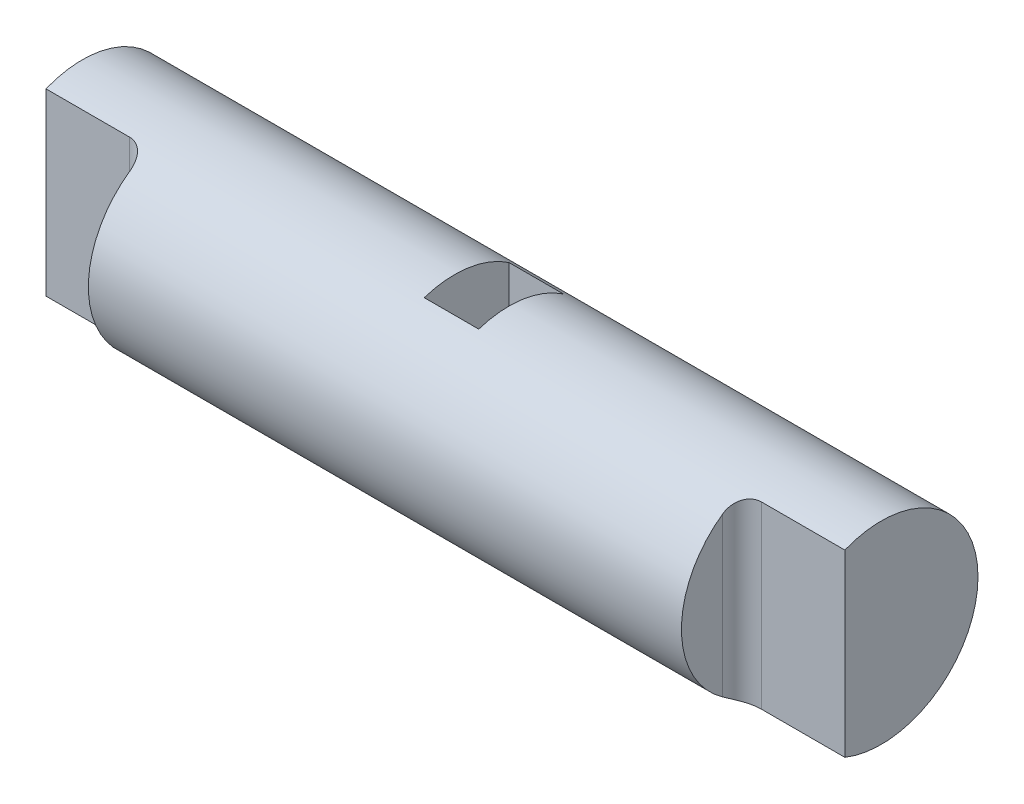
ISO-10303-21;
HEADER;
FILE_DESCRIPTION(('STEP AP214'),'2;1');
FILE_NAME('part.step','',(''),(''),'','','');
FILE_SCHEMA(('AUTOMOTIVE_DESIGN { 1 0 10303 214 1 1 1 1 }'));
ENDSEC;
DATA;
#1=APPLICATION_CONTEXT('core data for automotive mechanical design processes');
#2=APPLICATION_PROTOCOL_DEFINITION('international standard','automotive_design',2000,#1);
#3=PRODUCT_CONTEXT('',#1,'mechanical');
#4=PRODUCT('Part','Part','',(#3));
#5=PRODUCT_RELATED_PRODUCT_CATEGORY('part','',(#4));
#6=PRODUCT_DEFINITION_FORMATION('','',#4);
#7=PRODUCT_DEFINITION_CONTEXT('part definition',#1,'design');
#8=PRODUCT_DEFINITION('design','',#6,#7);
#9=PRODUCT_DEFINITION_SHAPE('','',#8);
#10=(LENGTH_UNIT() NAMED_UNIT(*) SI_UNIT(.MILLI.,.METRE.));
#11=(NAMED_UNIT(*) PLANE_ANGLE_UNIT() SI_UNIT($,.RADIAN.));
#12=(NAMED_UNIT(*) SI_UNIT($,.STERADIAN.) SOLID_ANGLE_UNIT());
#13=UNCERTAINTY_MEASURE_WITH_UNIT(LENGTH_MEASURE(1.E-05),#10,'distance_accuracy_value','');
#14=(GEOMETRIC_REPRESENTATION_CONTEXT(3) GLOBAL_UNCERTAINTY_ASSIGNED_CONTEXT((#13)) GLOBAL_UNIT_ASSIGNED_CONTEXT((#10,
#11,#12)) REPRESENTATION_CONTEXT('',''));
#15=CARTESIAN_POINT('',(0.,0.,0.));
#16=DIRECTION('',(0.,0.,1.));
#17=DIRECTION('',(1.,0.,0.));
#18=AXIS2_PLACEMENT_3D('',#15,#16,#17);
#19=CARTESIAN_POINT('',(-33.,0.,0.));
#20=DIRECTION('',(1.,0.,0.));
#21=DIRECTION('',(0.,1.,0.));
#22=AXIS2_PLACEMENT_3D('',#19,#20,#21);
#23=CYLINDRICAL_SURFACE('',#22,8.);
#24=DIRECTION('',(1.,0.,0.));
#25=VECTOR('',#24,1.);
#26=CARTESIAN_POINT('',(-33.,7.59934207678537,2.5));
#27=LINE('',#26,#25);
#28=CARTESIAN_POINT('',(-2.25,7.59934207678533,2.5));
#29=VERTEX_POINT('',#28);
#30=CARTESIAN_POINT('',(2.25,7.59934207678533,2.5));
#31=VERTEX_POINT('',#30);
#32=EDGE_CURVE('E160',#29,#31,#27,.T.);
#33=ORIENTED_EDGE('',*,*,#32,.F.);
#34=CARTESIAN_POINT('',(-2.25,0.,0.));
#35=DIRECTION('',(-1.,0.,0.));
#36=DIRECTION('',(0.,-1.,0.));
#37=AXIS2_PLACEMENT_3D('',#34,#35,#36);
#38=CIRCLE('',#37,8.);
#39=CARTESIAN_POINT('',(-2.25,6.61437827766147,-4.5));
#40=VERTEX_POINT('',#39);
#41=EDGE_CURVE('E100',#40,#29,#38,.F.);
#42=ORIENTED_EDGE('',*,*,#41,.F.);
#43=DIRECTION('',(1.,0.,0.));
#44=VECTOR('',#43,1.);
#45=CARTESIAN_POINT('',(-33.,6.61437827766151,-4.5));
#46=LINE('',#45,#44);
#47=CARTESIAN_POINT('',(2.25,6.61437827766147,-4.5));
#48=VERTEX_POINT('',#47);
#49=EDGE_CURVE('E155',#48,#40,#46,.F.);
#50=ORIENTED_EDGE('',*,*,#49,.F.);
#51=CARTESIAN_POINT('',(2.25,0.,0.));
#52=DIRECTION('',(1.,0.,0.));
#53=DIRECTION('',(0.,1.,0.));
#54=AXIS2_PLACEMENT_3D('',#51,#52,#53);
#55=CIRCLE('',#54,8.);
#56=EDGE_CURVE('E158',#31,#48,#55,.F.);
#57=ORIENTED_EDGE('',*,*,#56,.F.);
#58=EDGE_LOOP('',(#33,#42,#50,#57));
#59=FACE_BOUND('',#58,.T.);
#60=DIRECTION('',(-1.,0.,0.));
#61=VECTOR('',#60,1.);
#62=CARTESIAN_POINT('',(-24.5,7.41619848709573,3.));
#63=LINE('',#62,#61);
#64=CARTESIAN_POINT('',(-26.1,7.41619848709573,3.));
#65=VERTEX_POINT('',#64);
#66=CARTESIAN_POINT('',(-33.,7.41619848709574,3.));
#67=VERTEX_POINT('',#66);
#68=EDGE_CURVE('E132',#65,#67,#63,.T.);
#69=ORIENTED_EDGE('',*,*,#68,.F.);
#70=CARTESIAN_POINT('',(-26.1,7.41619848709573,3.));
#71=CARTESIAN_POINT('',(-26.057756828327,7.41619681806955,2.99999883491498));
#72=CARTESIAN_POINT('',(-26.0155343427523,7.41552148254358,3.00167417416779));
#73=CARTESIAN_POINT('',(-25.9314016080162,7.41281738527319,3.00834799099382));
#74=CARTESIAN_POINT('',(-25.8894913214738,7.41078878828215,3.01334606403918));
#75=CARTESIAN_POINT('',(-25.7648633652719,7.40267959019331,3.03324127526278));
#76=CARTESIAN_POINT('',(-25.6829980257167,7.39457562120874,3.05303980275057));
#77=CARTESIAN_POINT('',(-25.5240561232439,7.37294388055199,3.1049117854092));
#78=CARTESIAN_POINT('',(-25.4469802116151,7.35941537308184,3.13698690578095));
#79=CARTESIAN_POINT('',(-25.2996133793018,7.32693483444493,3.21211677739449));
#80=CARTESIAN_POINT('',(-25.2293235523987,7.307981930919,3.25517329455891));
#81=CARTESIAN_POINT('',(-25.0960491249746,7.26435373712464,3.35141687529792));
#82=CARTESIAN_POINT('',(-25.0332162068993,7.23958291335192,3.40477007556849));
#83=CARTESIAN_POINT('',(-24.917587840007,7.18473988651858,3.51902308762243));
#84=CARTESIAN_POINT('',(-24.8647914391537,7.15466818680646,3.57992218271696));
#85=CARTESIAN_POINT('',(-24.7669700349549,7.08755537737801,3.71110558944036));
#86=CARTESIAN_POINT('',(-24.7226306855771,7.05019756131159,3.78173780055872));
#87=CARTESIAN_POINT('',(-24.6461981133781,6.97044784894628,3.92679658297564));
#88=CARTESIAN_POINT('',(-24.6141259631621,6.92804745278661,4.00122943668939));
#89=CARTESIAN_POINT('',(-24.557950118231,6.83195686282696,4.16347866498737));
#90=CARTESIAN_POINT('',(-24.535873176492,6.7775376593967,4.25156973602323));
#91=CARTESIAN_POINT('',(-24.514148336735,6.69262673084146,4.38309087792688));
#92=CARTESIAN_POINT('',(-24.5088047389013,6.66381506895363,4.42677311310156));
#93=CARTESIAN_POINT('',(-24.5017340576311,6.60522242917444,4.5137326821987));
#94=CARTESIAN_POINT('',(-24.5000042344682,6.57544220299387,4.55701029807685));
#95=CARTESIAN_POINT('',(-24.5,6.54522726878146,4.6));
#96=B_SPLINE_CURVE_WITH_KNOTS('',3,(#70,#71,#72,#73,#74,#75,#76,#77,#78,#79,#80,#81,#82,#83,#84,
#85,#86,#87,#88,#89,#90,#91,#92,#93,#94,#95),.UNSPECIFIED.,.F.,.F.,(4,2,2,2,2,2,2,2,2,2,2,2,4),
(0.,0.126650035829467,0.253284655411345,0.505811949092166,0.758373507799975,1.01097570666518,
1.26805821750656,1.52511633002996,1.79812780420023,2.07160617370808,2.38779532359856,
2.54548638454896,2.70305785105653),.UNSPECIFIED.);
#97=CARTESIAN_POINT('',(-24.5,6.5452272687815,4.6));
#98=VERTEX_POINT('',#97);
#99=EDGE_CURVE('E177',#65,#98,#96,.T.);
#100=ORIENTED_EDGE('',*,*,#99,.T.);
#101=CARTESIAN_POINT('',(-24.5,0.,0.));
#102=DIRECTION('',(-1.,0.,0.));
#103=DIRECTION('',(0.,-1.,0.));
#104=AXIS2_PLACEMENT_3D('',#101,#102,#103);
#105=CIRCLE('',#104,8.);
#106=CARTESIAN_POINT('',(-24.5,-6.54522726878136,4.6));
#107=VERTEX_POINT('',#106);
#108=EDGE_CURVE('E129',#107,#98,#105,.T.);
#109=ORIENTED_EDGE('',*,*,#108,.F.);
#110=CARTESIAN_POINT('',(-24.5,-6.54522726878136,4.6));
#111=CARTESIAN_POINT('',(-24.4999978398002,-6.58442616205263,4.54424411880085));
#112=CARTESIAN_POINT('',(-24.5029157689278,-6.62291296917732,4.48794859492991));
#113=CARTESIAN_POINT('',(-24.514910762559,-6.69821941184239,4.37475031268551));
#114=CARTESIAN_POINT('',(-24.523999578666,-6.73503572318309,4.31784659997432));
#115=CARTESIAN_POINT('',(-24.5486984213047,-6.80672427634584,4.2039335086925));
#116=CARTESIAN_POINT('',(-24.5643298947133,-6.84158969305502,4.14692440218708));
#117=CARTESIAN_POINT('',(-24.6023395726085,-6.90888713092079,4.03380827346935));
#118=CARTESIAN_POINT('',(-24.6247113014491,-6.94132145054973,3.97770043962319));
#119=CARTESIAN_POINT('',(-24.6868946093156,-7.01613982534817,3.84469819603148));
#120=CARTESIAN_POINT('',(-24.7300991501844,-7.05721823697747,3.7686113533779));
#121=CARTESIAN_POINT('',(-24.8300357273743,-7.13318435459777,3.622767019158));
#122=CARTESIAN_POINT('',(-24.8867325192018,-7.16808778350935,3.55299368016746));
#123=CARTESIAN_POINT('',(-25.0132250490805,-7.23145403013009,3.42219060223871));
#124=CARTESIAN_POINT('',(-25.0830862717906,-7.25988300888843,3.36120738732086));
#125=CARTESIAN_POINT('',(-25.2340712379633,-7.30974977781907,3.25134132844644));
#126=CARTESIAN_POINT('',(-25.3152022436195,-7.3311830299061,3.2024663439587));
#127=CARTESIAN_POINT('',(-25.4789496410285,-7.36541674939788,3.12287694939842));
#128=CARTESIAN_POINT('',(-25.5608796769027,-7.37878749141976,3.09098912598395));
#129=CARTESIAN_POINT('',(-25.729485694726,-7.39952289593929,3.04102049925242));
#130=CARTESIAN_POINT('',(-25.8161526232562,-7.40689861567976,3.02291428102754));
#131=CARTESIAN_POINT('',(-25.9363003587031,-7.41293540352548,3.00805580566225));
#132=CARTESIAN_POINT('',(-25.9689830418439,-7.41416021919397,3.00503453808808));
#133=CARTESIAN_POINT('',(-26.0344385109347,-7.41579053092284,3.0010091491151));
#134=CARTESIAN_POINT('',(-26.0672110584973,-7.4161973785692,3.00000170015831));
#135=CARTESIAN_POINT('',(-26.1,-7.41619848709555,3.));
#136=B_SPLINE_CURVE_WITH_KNOTS('',3,(#110,#111,#112,#113,#114,#115,#116,#117,#118,#119,#120,
#121,#122,#123,#124,#125,#126,#127,#128,#129,#130,#131,#132,#133,#134,#135),.UNSPECIFIED.,.F.,
.F.,(4,2,2,2,2,2,2,2,2,2,2,2,4),(0.,0.204447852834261,0.409286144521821,0.614801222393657,
0.820119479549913,1.10878307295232,1.39670073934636,1.68609034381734,1.97566730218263,
2.24112898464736,2.50609993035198,2.60457893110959,2.70289507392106),.UNSPECIFIED.);
#137=CARTESIAN_POINT('',(-26.1,-7.41619848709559,3.));
#138=VERTEX_POINT('',#137);
#139=EDGE_CURVE('E171',#107,#138,#136,.T.);
#140=ORIENTED_EDGE('',*,*,#139,.T.);
#141=DIRECTION('',(-1.,0.,0.));
#142=VECTOR('',#141,1.);
#143=CARTESIAN_POINT('',(-24.5,-7.4161984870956,3.));
#144=LINE('',#143,#142);
#145=CARTESIAN_POINT('',(-33.,-7.41619848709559,3.));
#146=VERTEX_POINT('',#145);
#147=EDGE_CURVE('E135',#138,#146,#144,.T.);
#148=ORIENTED_EDGE('',*,*,#147,.T.);
#149=CARTESIAN_POINT('',(-33.,0.,0.));
#150=DIRECTION('',(1.,0.,0.));
#151=DIRECTION('',(0.,1.,0.));
#152=AXIS2_PLACEMENT_3D('',#149,#150,#151);
#153=CIRCLE('',#152,8.);
#154=EDGE_CURVE('E151',#146,#67,#153,.T.);
#155=ORIENTED_EDGE('',*,*,#154,.T.);
#156=EDGE_LOOP('',(#69,#100,#109,#140,#148,#155));
#157=FACE_BOUND('',#156,.T.);
#158=CARTESIAN_POINT('',(24.5,0.,0.));
#159=DIRECTION('',(1.,0.,0.));
#160=DIRECTION('',(0.,1.,0.));
#161=AXIS2_PLACEMENT_3D('',#158,#159,#160);
#162=CIRCLE('',#161,8.);
#163=CARTESIAN_POINT('',(24.5,6.54522726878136,4.6));
#164=VERTEX_POINT('',#163);
#165=CARTESIAN_POINT('',(24.5,-6.5452272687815,4.6));
#166=VERTEX_POINT('',#165);
#167=EDGE_CURVE('E139',#164,#166,#162,.T.);
#168=ORIENTED_EDGE('',*,*,#167,.F.);
#169=CARTESIAN_POINT('',(24.5,6.54522726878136,4.6));
#170=CARTESIAN_POINT('',(24.4999978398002,6.58442616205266,4.54424411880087));
#171=CARTESIAN_POINT('',(24.5029157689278,6.62291296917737,4.48794859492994));
#172=CARTESIAN_POINT('',(24.514910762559,6.69821941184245,4.37475031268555));
#173=CARTESIAN_POINT('',(24.523999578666,6.73503572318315,4.31784659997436));
#174=CARTESIAN_POINT('',(24.5486984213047,6.80672427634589,4.20393350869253));
#175=CARTESIAN_POINT('',(24.5643298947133,6.84158969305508,4.14692440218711));
#176=CARTESIAN_POINT('',(24.6023395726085,6.90888713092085,4.03380827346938));
#177=CARTESIAN_POINT('',(24.6247113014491,6.94132145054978,3.97770043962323));
#178=CARTESIAN_POINT('',(24.6868946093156,7.01613982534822,3.84469819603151));
#179=CARTESIAN_POINT('',(24.7300991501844,7.05721823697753,3.76861135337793));
#180=CARTESIAN_POINT('',(24.8300357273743,7.13318435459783,3.62276701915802));
#181=CARTESIAN_POINT('',(24.8867325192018,7.16808778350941,3.55299368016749));
#182=CARTESIAN_POINT('',(25.0132250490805,7.23145403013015,3.42219060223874));
#183=CARTESIAN_POINT('',(25.0830862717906,7.2598830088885,3.36120738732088));
#184=CARTESIAN_POINT('',(25.2340712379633,7.30974977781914,3.25134132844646));
#185=CARTESIAN_POINT('',(25.3152022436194,7.33118302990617,3.20246634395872));
#186=CARTESIAN_POINT('',(25.4789496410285,7.36541674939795,3.12287694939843));
#187=CARTESIAN_POINT('',(25.5608796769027,7.37878749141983,3.09098912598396));
#188=CARTESIAN_POINT('',(25.729485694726,7.39952289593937,3.04102049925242));
#189=CARTESIAN_POINT('',(25.8161526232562,7.40689861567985,3.02291428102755));
#190=CARTESIAN_POINT('',(25.9363003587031,7.41293540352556,3.00805580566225));
#191=CARTESIAN_POINT('',(25.9689830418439,7.41416021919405,3.00503453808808));
#192=CARTESIAN_POINT('',(26.0344385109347,7.41579053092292,3.0010091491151));
#193=CARTESIAN_POINT('',(26.0672110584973,7.41619737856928,3.00000170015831));
#194=CARTESIAN_POINT('',(26.1,7.41619848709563,3.));
#195=B_SPLINE_CURVE_WITH_KNOTS('',3,(#169,#170,#171,#172,#173,#174,#175,#176,#177,#178,#179,
#180,#181,#182,#183,#184,#185,#186,#187,#188,#189,#190,#191,#192,#193,#194),.UNSPECIFIED.,.F.,
.F.,(4,2,2,2,2,2,2,2,2,2,2,2,4),(0.,0.204447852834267,0.409286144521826,0.614801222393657,
0.820119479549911,1.10878307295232,1.39670073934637,1.68609034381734,1.97566730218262,
2.24112898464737,2.50609993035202,2.60457893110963,2.7028950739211),.UNSPECIFIED.);
#196=CARTESIAN_POINT('',(26.1,7.41619848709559,3.));
#197=VERTEX_POINT('',#196);
#198=EDGE_CURVE('E28',#164,#197,#195,.T.);
#199=ORIENTED_EDGE('',*,*,#198,.T.);
#200=DIRECTION('',(1.,0.,0.));
#201=VECTOR('',#200,1.);
#202=CARTESIAN_POINT('',(24.5,7.4161984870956,3.));
#203=LINE('',#202,#201);
#204=CARTESIAN_POINT('',(33.,7.41619848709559,3.));
#205=VERTEX_POINT('',#204);
#206=EDGE_CURVE('E145',#197,#205,#203,.T.);
#207=ORIENTED_EDGE('',*,*,#206,.T.);
#208=CARTESIAN_POINT('',(33.,0.,0.));
#209=DIRECTION('',(1.,0.,0.));
#210=DIRECTION('',(0.,1.,0.));
#211=AXIS2_PLACEMENT_3D('',#208,#209,#210);
#212=CIRCLE('',#211,8.);
#213=CARTESIAN_POINT('',(33.,-7.41619848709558,3.));
#214=VERTEX_POINT('',#213);
#215=EDGE_CURVE('E147',#214,#205,#212,.T.);
#216=ORIENTED_EDGE('',*,*,#215,.F.);
#217=DIRECTION('',(1.,0.,0.));
#218=VECTOR('',#217,1.);
#219=CARTESIAN_POINT('',(24.5,-7.41619848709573,3.));
#220=LINE('',#219,#218);
#221=CARTESIAN_POINT('',(26.1,-7.41619848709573,3.));
#222=VERTEX_POINT('',#221);
#223=EDGE_CURVE('E142',#222,#214,#220,.T.);
#224=ORIENTED_EDGE('',*,*,#223,.F.);
#225=CARTESIAN_POINT('',(26.1,-7.41619848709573,3.));
#226=CARTESIAN_POINT('',(26.057756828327,-7.41619681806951,2.99999883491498));
#227=CARTESIAN_POINT('',(26.0155343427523,-7.41552148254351,3.00167417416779));
#228=CARTESIAN_POINT('',(25.9314016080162,-7.41281738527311,3.00834799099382));
#229=CARTESIAN_POINT('',(25.8894913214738,-7.41078878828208,3.01334606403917));
#230=CARTESIAN_POINT('',(25.764863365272,-7.40267959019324,3.03324127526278));
#231=CARTESIAN_POINT('',(25.6829980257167,-7.39457562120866,3.05303980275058));
#232=CARTESIAN_POINT('',(25.5240561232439,-7.37294388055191,3.1049117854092));
#233=CARTESIAN_POINT('',(25.4469802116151,-7.35941537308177,3.13698690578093));
#234=CARTESIAN_POINT('',(25.2996133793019,-7.32693483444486,3.21211677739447));
#235=CARTESIAN_POINT('',(25.2293235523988,-7.30798193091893,3.25517329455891));
#236=CARTESIAN_POINT('',(25.0960491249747,-7.26435373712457,3.35141687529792));
#237=CARTESIAN_POINT('',(25.0332162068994,-7.23958291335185,3.40477007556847));
#238=CARTESIAN_POINT('',(24.917587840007,-7.18473988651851,3.5190230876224));
#239=CARTESIAN_POINT('',(24.8647914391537,-7.15466818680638,3.57992218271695));
#240=CARTESIAN_POINT('',(24.766970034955,-7.08755537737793,3.71110558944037));
#241=CARTESIAN_POINT('',(24.7226306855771,-7.05019756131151,3.78173780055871));
#242=CARTESIAN_POINT('',(24.6461981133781,-6.97044784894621,3.92679658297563));
#243=CARTESIAN_POINT('',(24.6141259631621,-6.92804745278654,4.00122943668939));
#244=CARTESIAN_POINT('',(24.557950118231,-6.83195686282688,4.16347866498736));
#245=CARTESIAN_POINT('',(24.535873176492,-6.77753765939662,4.25156973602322));
#246=CARTESIAN_POINT('',(24.514148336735,-6.69262673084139,4.38309087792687));
#247=CARTESIAN_POINT('',(24.5088047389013,-6.66381506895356,4.42677311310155));
#248=CARTESIAN_POINT('',(24.5017340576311,-6.60522242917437,4.51373268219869));
#249=CARTESIAN_POINT('',(24.5000042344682,-6.5754422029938,4.55701029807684));
#250=CARTESIAN_POINT('',(24.5,-6.54522726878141,4.6));
#251=B_SPLINE_CURVE_WITH_KNOTS('',3,(#225,#226,#227,#228,#229,#230,#231,#232,#233,#234,#235,
#236,#237,#238,#239,#240,#241,#242,#243,#244,#245,#246,#247,#248,#249,#250),.UNSPECIFIED.,.F.,
.F.,(4,2,2,2,2,2,2,2,2,2,2,2,4),(0.,0.126650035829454,0.253284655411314,0.505811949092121,
0.758373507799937,1.01097570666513,1.26805821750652,1.52511633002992,1.79812780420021,
2.07160617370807,2.38779532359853,2.54548638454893,2.7030578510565),.UNSPECIFIED.);
#252=EDGE_CURVE('E9',#222,#166,#251,.T.);
#253=ORIENTED_EDGE('',*,*,#252,.T.);
#254=EDGE_LOOP('',(#168,#199,#207,#216,#224,#253));
#255=FACE_BOUND('',#254,.T.);
#256=ADVANCED_FACE('F14',(#59,#157,#255),#23,.T.);
#257=CARTESIAN_POINT('',(-33.,8.,0.));
#258=DIRECTION('',(-1.,0.,0.));
#259=DIRECTION('',(0.,-1.,0.));
#260=AXIS2_PLACEMENT_3D('',#257,#258,#259);
#261=PLANE('',#260);
#262=DIRECTION('',(0.,-1.,0.));
#263=VECTOR('',#262,1.);
#264=CARTESIAN_POINT('',(-33.,7.41619848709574,3.));
#265=LINE('',#264,#263);
#266=EDGE_CURVE('E125',#67,#146,#265,.T.);
#267=ORIENTED_EDGE('',*,*,#266,.F.);
#268=ORIENTED_EDGE('',*,*,#154,.F.);
#269=EDGE_LOOP('',(#267,#268));
#270=FACE_BOUND('',#269,.T.);
#271=ADVANCED_FACE('F187',(#270),#261,.T.);
#272=CARTESIAN_POINT('',(33.,0.,0.));
#273=DIRECTION('',(1.,0.,0.));
#274=DIRECTION('',(0.,1.,0.));
#275=AXIS2_PLACEMENT_3D('',#272,#273,#274);
#276=PLANE('',#275);
#277=DIRECTION('',(0.,1.,0.));
#278=VECTOR('',#277,1.);
#279=CARTESIAN_POINT('',(33.,-7.41619848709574,3.));
#280=LINE('',#279,#278);
#281=EDGE_CURVE('E137',#214,#205,#280,.T.);
#282=ORIENTED_EDGE('',*,*,#281,.F.);
#283=ORIENTED_EDGE('',*,*,#215,.T.);
#284=EDGE_LOOP('',(#282,#283));
#285=FACE_BOUND('',#284,.T.);
#286=ADVANCED_FACE('F213',(#285),#276,.T.);
#287=CARTESIAN_POINT('',(24.5,-7.41619848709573,3.));
#288=DIRECTION('',(0.,0.,-1.));
#289=DIRECTION('',(-1.,0.,0.));
#290=AXIS2_PLACEMENT_3D('',#287,#288,#289);
#291=PLANE('',#290);
#292=ORIENTED_EDGE('',*,*,#206,.F.);
#293=DIRECTION('',(0.,1.,0.));
#294=VECTOR('',#293,1.);
#295=CARTESIAN_POINT('',(26.1,-7.41619848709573,3.));
#296=LINE('',#295,#294);
#297=EDGE_CURVE('E35',#197,#222,#296,.F.);
#298=ORIENTED_EDGE('',*,*,#297,.T.);
#299=ORIENTED_EDGE('',*,*,#223,.T.);
#300=ORIENTED_EDGE('',*,*,#281,.T.);
#301=EDGE_LOOP('',(#292,#298,#299,#300));
#302=FACE_BOUND('',#301,.T.);
#303=ADVANCED_FACE('F219',(#302),#291,.F.);
#304=CARTESIAN_POINT('',(24.5,0.,0.));
#305=DIRECTION('',(1.,0.,0.));
#306=DIRECTION('',(0.,1.,0.));
#307=AXIS2_PLACEMENT_3D('',#304,#305,#306);
#308=PLANE('',#307);
#309=ORIENTED_EDGE('',*,*,#167,.T.);
#310=DIRECTION('',(0.,1.,0.));
#311=VECTOR('',#310,1.);
#312=CARTESIAN_POINT('',(24.5,0.,4.6));
#313=LINE('',#312,#311);
#314=EDGE_CURVE('E167',#166,#164,#313,.T.);
#315=ORIENTED_EDGE('',*,*,#314,.T.);
#316=EDGE_LOOP('',(#309,#315));
#317=FACE_BOUND('',#316,.T.);
#318=ADVANCED_FACE('F225',(#317),#308,.T.);
#319=CARTESIAN_POINT('',(-24.5,7.41619848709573,3.));
#320=DIRECTION('',(0.,0.,-1.));
#321=DIRECTION('',(-1.,0.,0.));
#322=AXIS2_PLACEMENT_3D('',#319,#320,#321);
#323=PLANE('',#322);
#324=ORIENTED_EDGE('',*,*,#147,.F.);
#325=DIRECTION('',(0.,-1.,0.));
#326=VECTOR('',#325,1.);
#327=CARTESIAN_POINT('',(-26.1,7.41619848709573,3.));
#328=LINE('',#327,#326);
#329=EDGE_CURVE('E165',#138,#65,#328,.F.);
#330=ORIENTED_EDGE('',*,*,#329,.T.);
#331=ORIENTED_EDGE('',*,*,#68,.T.);
#332=ORIENTED_EDGE('',*,*,#266,.T.);
#333=EDGE_LOOP('',(#324,#330,#331,#332));
#334=FACE_BOUND('',#333,.T.);
#335=ADVANCED_FACE('F208',(#334),#323,.F.);
#336=CARTESIAN_POINT('',(-24.5,0.,0.));
#337=DIRECTION('',(-1.,0.,0.));
#338=DIRECTION('',(0.,-1.,0.));
#339=AXIS2_PLACEMENT_3D('',#336,#337,#338);
#340=PLANE('',#339);
#341=ORIENTED_EDGE('',*,*,#108,.T.);
#342=DIRECTION('',(0.,-1.,0.));
#343=VECTOR('',#342,1.);
#344=CARTESIAN_POINT('',(-24.5,0.,4.6));
#345=LINE('',#344,#343);
#346=EDGE_CURVE('E162',#98,#107,#345,.T.);
#347=ORIENTED_EDGE('',*,*,#346,.T.);
#348=EDGE_LOOP('',(#341,#347));
#349=FACE_BOUND('',#348,.T.);
#350=ADVANCED_FACE('F205',(#349),#340,.T.);
#351=CARTESIAN_POINT('',(2.25000000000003,13.,2.5));
#352=DIRECTION('',(0.,0.,1.));
#353=DIRECTION('',(1.,0.,0.));
#354=AXIS2_PLACEMENT_3D('',#351,#352,#353);
#355=PLANE('',#354);
#356=ORIENTED_EDGE('',*,*,#32,.T.);
#357=DIRECTION('',(0.,-1.,0.));
#358=VECTOR('',#357,1.);
#359=CARTESIAN_POINT('',(2.25000000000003,13.,2.5));
#360=LINE('',#359,#358);
#361=CARTESIAN_POINT('',(2.25,3.,2.5));
#362=VERTEX_POINT('',#361);
#363=EDGE_CURVE('E119',#31,#362,#360,.T.);
#364=ORIENTED_EDGE('',*,*,#363,.T.);
#365=DIRECTION('',(-1.,0.,0.));
#366=VECTOR('',#365,1.);
#367=CARTESIAN_POINT('',(2.25,3.,2.5));
#368=LINE('',#367,#366);
#369=CARTESIAN_POINT('',(-2.25,3.,2.5));
#370=VERTEX_POINT('',#369);
#371=EDGE_CURVE('E112',#362,#370,#368,.T.);
#372=ORIENTED_EDGE('',*,*,#371,.T.);
#373=DIRECTION('',(0.,-1.,0.));
#374=VECTOR('',#373,1.);
#375=CARTESIAN_POINT('',(-2.24999999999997,13.,2.5));
#376=LINE('',#375,#374);
#377=EDGE_CURVE('E95',#29,#370,#376,.T.);
#378=ORIENTED_EDGE('',*,*,#377,.F.);
#379=EDGE_LOOP('',(#356,#364,#372,#378));
#380=FACE_BOUND('',#379,.T.);
#381=ADVANCED_FACE('F117',(#380),#355,.F.);
#382=CARTESIAN_POINT('',(2.25000000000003,13.,-4.5));
#383=DIRECTION('',(1.,0.,0.));
#384=DIRECTION('',(0.,1.,0.));
#385=AXIS2_PLACEMENT_3D('',#382,#383,#384);
#386=PLANE('',#385);
#387=ORIENTED_EDGE('',*,*,#56,.T.);
#388=DIRECTION('',(0.,-1.,0.));
#389=VECTOR('',#388,1.);
#390=CARTESIAN_POINT('',(2.25000000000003,13.,-4.5));
#391=LINE('',#390,#389);
#392=CARTESIAN_POINT('',(2.25,3.,-4.5));
#393=VERTEX_POINT('',#392);
#394=EDGE_CURVE('E126',#48,#393,#391,.T.);
#395=ORIENTED_EDGE('',*,*,#394,.T.);
#396=DIRECTION('',(0.,0.,1.));
#397=VECTOR('',#396,1.);
#398=CARTESIAN_POINT('',(2.25,3.,-4.5));
#399=LINE('',#398,#397);
#400=EDGE_CURVE('E105',#393,#362,#399,.T.);
#401=ORIENTED_EDGE('',*,*,#400,.T.);
#402=ORIENTED_EDGE('',*,*,#363,.F.);
#403=EDGE_LOOP('',(#387,#395,#401,#402));
#404=FACE_BOUND('',#403,.T.);
#405=ADVANCED_FACE('F238',(#404),#386,.F.);
#406=CARTESIAN_POINT('',(-2.24999999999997,13.,-4.5));
#407=DIRECTION('',(0.,0.,-1.));
#408=DIRECTION('',(-1.,0.,0.));
#409=AXIS2_PLACEMENT_3D('',#406,#407,#408);
#410=PLANE('',#409);
#411=ORIENTED_EDGE('',*,*,#49,.T.);
#412=DIRECTION('',(0.,-1.,0.));
#413=VECTOR('',#412,1.);
#414=CARTESIAN_POINT('',(-2.24999999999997,13.,-4.5));
#415=LINE('',#414,#413);
#416=CARTESIAN_POINT('',(-2.25,3.,-4.5));
#417=VERTEX_POINT('',#416);
#418=EDGE_CURVE('E104',#40,#417,#415,.T.);
#419=ORIENTED_EDGE('',*,*,#418,.T.);
#420=DIRECTION('',(1.,0.,0.));
#421=VECTOR('',#420,1.);
#422=CARTESIAN_POINT('',(-2.25,3.,-4.5));
#423=LINE('',#422,#421);
#424=EDGE_CURVE('E115',#417,#393,#423,.T.);
#425=ORIENTED_EDGE('',*,*,#424,.T.);
#426=ORIENTED_EDGE('',*,*,#394,.F.);
#427=EDGE_LOOP('',(#411,#419,#425,#426));
#428=FACE_BOUND('',#427,.T.);
#429=ADVANCED_FACE('F241',(#428),#410,.F.);
#430=CARTESIAN_POINT('',(-2.24999999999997,13.,2.5));
#431=DIRECTION('',(-1.,0.,0.));
#432=DIRECTION('',(0.,-1.,0.));
#433=AXIS2_PLACEMENT_3D('',#430,#431,#432);
#434=PLANE('',#433);
#435=ORIENTED_EDGE('',*,*,#41,.T.);
#436=ORIENTED_EDGE('',*,*,#377,.T.);
#437=DIRECTION('',(0.,0.,-1.));
#438=VECTOR('',#437,1.);
#439=CARTESIAN_POINT('',(-2.25,3.,2.5));
#440=LINE('',#439,#438);
#441=EDGE_CURVE('E98',#370,#417,#440,.T.);
#442=ORIENTED_EDGE('',*,*,#441,.T.);
#443=ORIENTED_EDGE('',*,*,#418,.F.);
#444=EDGE_LOOP('',(#435,#436,#442,#443));
#445=FACE_BOUND('',#444,.T.);
#446=ADVANCED_FACE('F97',(#445),#434,.F.);
#447=CARTESIAN_POINT('',(0.,3.,0.));
#448=DIRECTION('',(0.,-1.,0.));
#449=DIRECTION('',(1.,0.,0.));
#450=AXIS2_PLACEMENT_3D('',#447,#448,#449);
#451=PLANE('',#450);
#452=ORIENTED_EDGE('',*,*,#371,.F.);
#453=ORIENTED_EDGE('',*,*,#400,.F.);
#454=ORIENTED_EDGE('',*,*,#424,.F.);
#455=ORIENTED_EDGE('',*,*,#441,.F.);
#456=EDGE_LOOP('',(#452,#453,#454,#455));
#457=FACE_BOUND('',#456,.T.);
#458=ADVANCED_FACE('F110',(#457),#451,.F.);
#459=CARTESIAN_POINT('',(-26.1,0.,4.6));
#460=DIRECTION('',(0.,-1.,0.));
#461=DIRECTION('',(1.,0.,0.));
#462=AXIS2_PLACEMENT_3D('',#459,#460,#461);
#463=CYLINDRICAL_SURFACE('',#462,1.6);
#464=ORIENTED_EDGE('',*,*,#99,.F.);
#465=ORIENTED_EDGE('',*,*,#329,.F.);
#466=ORIENTED_EDGE('',*,*,#139,.F.);
#467=ORIENTED_EDGE('',*,*,#346,.F.);
#468=EDGE_LOOP('',(#464,#465,#466,#467));
#469=FACE_BOUND('',#468,.T.);
#470=ADVANCED_FACE('F182',(#469),#463,.F.);
#471=CARTESIAN_POINT('',(26.1,0.,4.6));
#472=DIRECTION('',(0.,1.,0.));
#473=DIRECTION('',(-1.,0.,0.));
#474=AXIS2_PLACEMENT_3D('',#471,#472,#473);
#475=CYLINDRICAL_SURFACE('',#474,1.6);
#476=ORIENTED_EDGE('',*,*,#252,.F.);
#477=ORIENTED_EDGE('',*,*,#297,.F.);
#478=ORIENTED_EDGE('',*,*,#198,.F.);
#479=ORIENTED_EDGE('',*,*,#314,.F.);
#480=EDGE_LOOP('',(#476,#477,#478,#479));
#481=FACE_BOUND('',#480,.T.);
#482=ADVANCED_FACE('F16',(#481),#475,.F.);
#483=CLOSED_SHELL('',(#256,#271,#286,#303,#318,#335,#350,#381,#405,#429,#446,#458,#470,#482));
#484=MANIFOLD_SOLID_BREP('B1',#483);
#485=ADVANCED_BREP_SHAPE_REPRESENTATION('',(#18,#484),#14);
#486=SHAPE_DEFINITION_REPRESENTATION(#9,#485);
ENDSEC;
END-ISO-10303-21;
